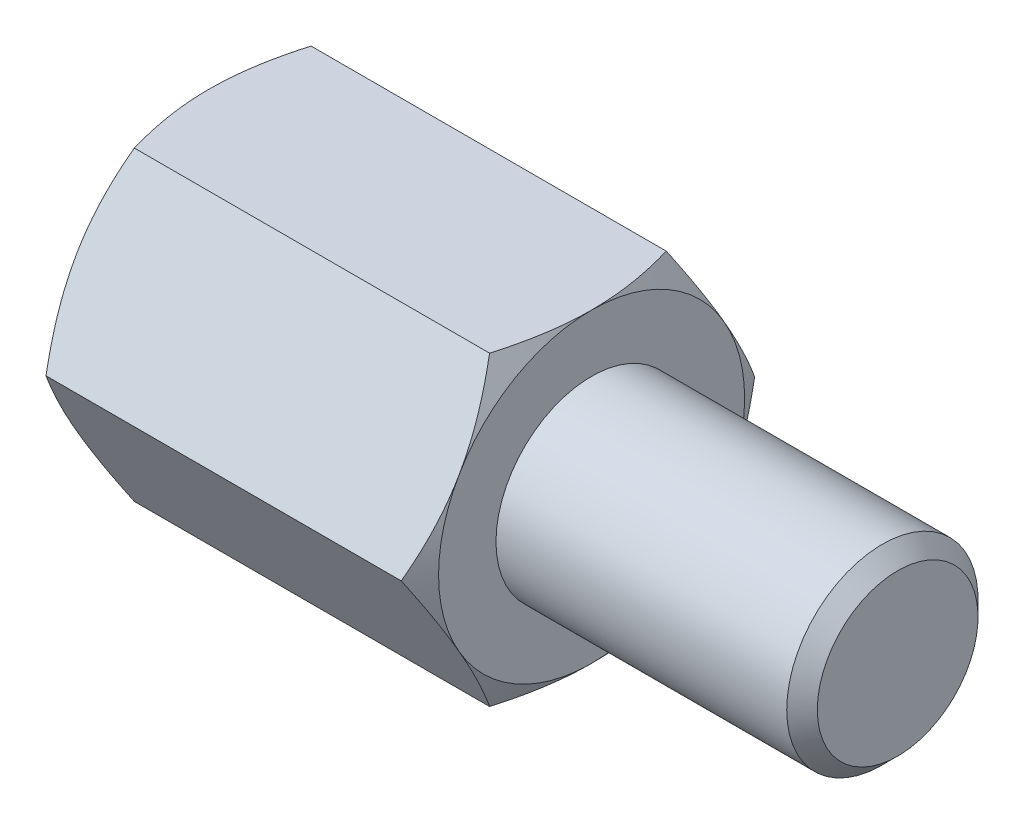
from build123d import *

# Parameters (mm, degrees)
EXTRUDE2_DEPTH = 5
SKETCH3_R      = 2.1
EXTRUDE3_DEPTH = 5
SKETCH5_R      = 2.5
EXTRUDE4_DEPTH = 8
CHAMFER1_SIZE  = 0.4


with BuildPart() as part:
    # Sketch1 → Extrude2 (new, symmetric)
    with BuildSketch(Plane(origin=(0, 0, 0), x_dir=(0, 0, -1), z_dir=(1, 0, 0))):
        Polygon((2.309401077, 4), (-2.309401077, 4), (-4.618802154, 0), (-2.309401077, -4), (2.309401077, -4), (4.618802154, 0), align=None)
    extrude(amount=EXTRUDE2_DEPTH, both=True)

    # Sketch2 → Cut-Revolve1 (revolve, cut)
    with BuildSketch(Plane.XY):
        with BuildLine():
            Line((-5, 4), (-3.5, 6.598076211))
            ThreePointArc((-3.5, 6.598076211), (-3.98810136, 7.776457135), (-5, 7))
            Line((-5, 7), (-5, 4))
        make_face()
    cut_revolve1 = revolve(axis=Axis((0, 0, 0), (1, 0, 0)), mode=Mode.SUBTRACT)

    # Mirror1: Cut-Revolve1 across plane
    add(cut_revolve1.mirror(Plane(origin=(0, 0, 0), x_dir=(0, 0, 1), z_dir=(1, 0, 0))), mode=Mode.SUBTRACT)

    # Sketch3 → Extrude3 (cut)
    with BuildSketch(Plane.ZY.offset(5)):
        Circle(SKETCH3_R)
    extrude(amount=-EXTRUDE3_DEPTH, mode=Mode.SUBTRACT)

    # Sketch4 → Cut-Revolve2 (revolve, cut)
    with BuildSketch(Plane.XY, mode=Mode.PRIVATE) as cut_revolve2_sk:
        Polygon((0, 0), (0, 2.1), (1.212435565, 0), align=None)
    revolve(cut_revolve2_sk.sketch.rotate(Axis((1.212435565, 0, 0), (-1, 0, 0)), 270), axis=Axis((1.212435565, 0, 0), (-1, 0, 0)), mode=Mode.SUBTRACT)

    # Sketch5 → Extrude4 (add)
    with BuildSketch(Plane(origin=(5, 0, 0), x_dir=(0, 0, -1), z_dir=(1, 0, 0))):
        Circle(SKETCH5_R)
    extrude(amount=EXTRUDE4_DEPTH)

    # Chamfer1
    chamfer1_edges = [part.edges().sort_by_distance(p)[0] for p in [
        (13, 0, 2.5),
    ]]
    chamfer(chamfer1_edges, length=CHAMFER1_SIZE)


solid = part.part
